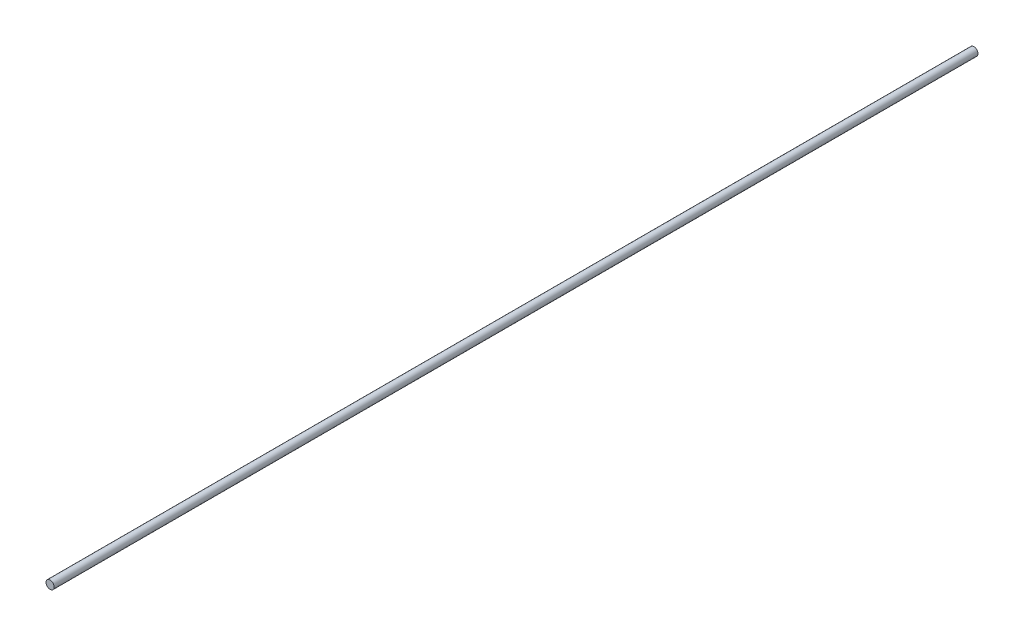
ISO-10303-21;
HEADER;
FILE_DESCRIPTION(('STEP AP214'),'2;1');
FILE_NAME('part.step','',(''),(''),'','','');
FILE_SCHEMA(('AUTOMOTIVE_DESIGN { 1 0 10303 214 1 1 1 1 }'));
ENDSEC;
DATA;
#1=APPLICATION_CONTEXT('core data for automotive mechanical design processes');
#2=APPLICATION_PROTOCOL_DEFINITION('international standard','automotive_design',2000,#1);
#3=PRODUCT_CONTEXT('',#1,'mechanical');
#4=PRODUCT('Part','Part','',(#3));
#5=PRODUCT_RELATED_PRODUCT_CATEGORY('part','',(#4));
#6=PRODUCT_DEFINITION_FORMATION('','',#4);
#7=PRODUCT_DEFINITION_CONTEXT('part definition',#1,'design');
#8=PRODUCT_DEFINITION('design','',#6,#7);
#9=PRODUCT_DEFINITION_SHAPE('','',#8);
#10=(LENGTH_UNIT() NAMED_UNIT(*) SI_UNIT(.MILLI.,.METRE.));
#11=(NAMED_UNIT(*) PLANE_ANGLE_UNIT() SI_UNIT($,.RADIAN.));
#12=(NAMED_UNIT(*) SI_UNIT($,.STERADIAN.) SOLID_ANGLE_UNIT());
#13=UNCERTAINTY_MEASURE_WITH_UNIT(LENGTH_MEASURE(1.E-05),#10,'distance_accuracy_value','');
#14=(GEOMETRIC_REPRESENTATION_CONTEXT(3) GLOBAL_UNCERTAINTY_ASSIGNED_CONTEXT((#13)) GLOBAL_UNIT_ASSIGNED_CONTEXT((#10,
#11,#12)) REPRESENTATION_CONTEXT('',''));
#15=CARTESIAN_POINT('',(0.,0.,0.));
#16=DIRECTION('',(0.,0.,1.));
#17=DIRECTION('',(1.,0.,0.));
#18=AXIS2_PLACEMENT_3D('',#15,#16,#17);
#19=CARTESIAN_POINT('',(0.,1.11022302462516E-13,720.725));
#20=DIRECTION('',(0.,0.,-1.));
#21=DIRECTION('',(-1.,0.,0.));
#22=AXIS2_PLACEMENT_3D('',#19,#20,#21);
#23=CYLINDRICAL_SURFACE('',#22,6.34999999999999);
#24=CARTESIAN_POINT('',(0.,1.11022302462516E-13,720.725));
#25=DIRECTION('',(0.,0.,1.));
#26=DIRECTION('',(1.,0.,0.));
#27=AXIS2_PLACEMENT_3D('',#24,#25,#26);
#28=CIRCLE('',#27,6.34999999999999);
#29=CARTESIAN_POINT('',(6.34999999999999,1.11022302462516E-13,720.725));
#30=VERTEX_POINT('',#29);
#31=EDGE_CURVE('E12',#30,#30,#28,.T.);
#32=ORIENTED_EDGE('',*,*,#31,.F.);
#33=EDGE_LOOP('',(#32));
#34=FACE_BOUND('',#33,.T.);
#35=CARTESIAN_POINT('',(0.,0.,-720.725));
#36=DIRECTION('',(0.,0.,1.));
#37=DIRECTION('',(1.,0.,0.));
#38=AXIS2_PLACEMENT_3D('',#35,#36,#37);
#39=CIRCLE('',#38,6.34999999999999);
#40=CARTESIAN_POINT('',(6.34999999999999,0.,-720.725));
#41=VERTEX_POINT('',#40);
#42=EDGE_CURVE('E42',#41,#41,#39,.T.);
#43=ORIENTED_EDGE('',*,*,#42,.T.);
#44=EDGE_LOOP('',(#43));
#45=FACE_BOUND('',#44,.T.);
#46=ADVANCED_FACE('F36',(#34,#45),#23,.T.);
#47=CARTESIAN_POINT('',(0.,1.11022302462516E-13,720.725));
#48=DIRECTION('',(0.,0.,1.));
#49=DIRECTION('',(1.,0.,0.));
#50=AXIS2_PLACEMENT_3D('',#47,#48,#49);
#51=PLANE('',#50);
#52=ORIENTED_EDGE('',*,*,#31,.T.);
#53=EDGE_LOOP('',(#52));
#54=FACE_BOUND('',#53,.T.);
#55=ADVANCED_FACE('F51',(#54),#51,.T.);
#56=CARTESIAN_POINT('',(0.,0.,-720.725));
#57=DIRECTION('',(0.,0.,1.));
#58=DIRECTION('',(1.,0.,0.));
#59=AXIS2_PLACEMENT_3D('',#56,#57,#58);
#60=PLANE('',#59);
#61=ORIENTED_EDGE('',*,*,#42,.F.);
#62=EDGE_LOOP('',(#61));
#63=FACE_BOUND('',#62,.T.);
#64=ADVANCED_FACE('F49',(#63),#60,.F.);
#65=CLOSED_SHELL('',(#46,#55,#64));
#66=MANIFOLD_SOLID_BREP('B2',#65);
#67=ADVANCED_BREP_SHAPE_REPRESENTATION('',(#18,#66),#14);
#68=SHAPE_DEFINITION_REPRESENTATION(#9,#67);
ENDSEC;
END-ISO-10303-21;
